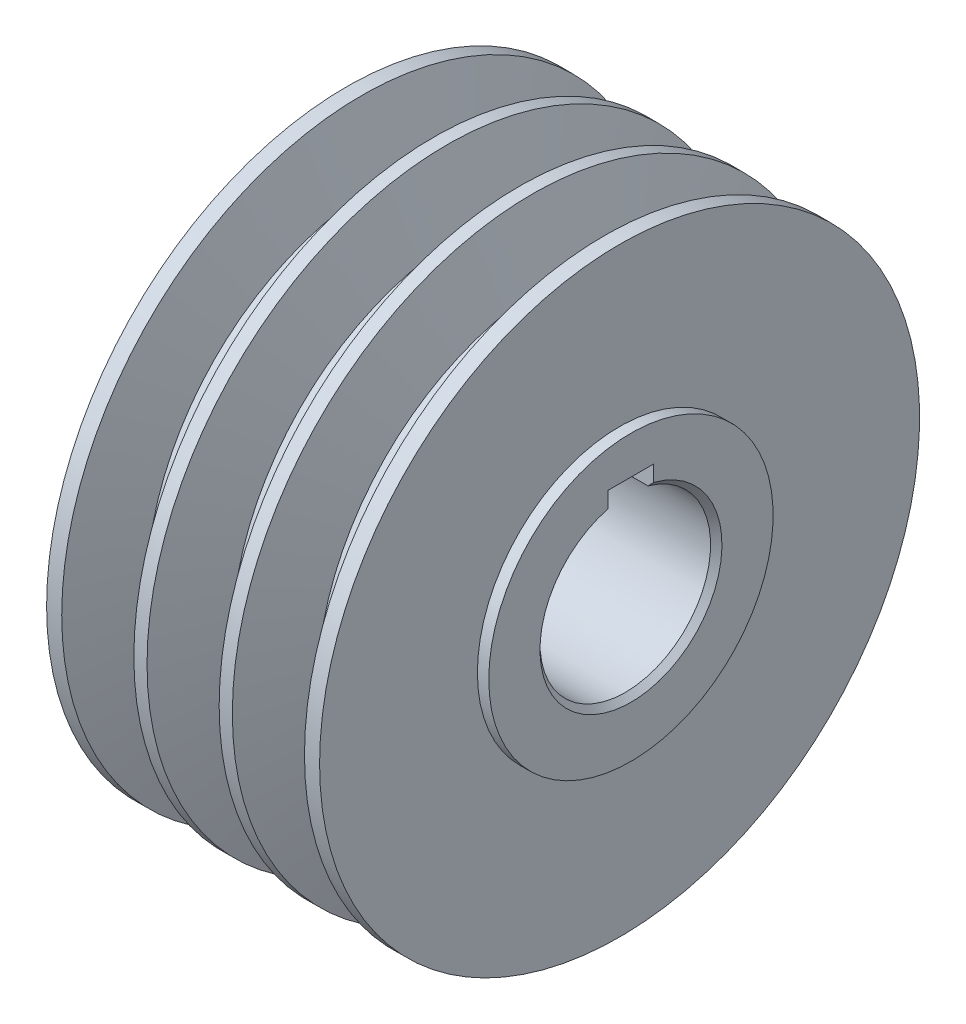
from build123d import *

# Parameters (mm, degrees)
PATTERN_LINEAR_1_COUNT = 3
PATTERN_LINEAR_1_PITCH = 15
CHAMFER_1_SIZE         = 1
SKETCH_4_W             = 8
SKETCH_4_H             = 3.843167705
CUT_EXTRUDE_1_DEPTH    = 90.806040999


with BuildPart() as part:
    # Sketch 1 → Revolve 1 (revolve)
    with BuildSketch(Plane.XY, mode=Mode.PRIVATE) as revolve_1_sk:
        Polygon((0, 15), (0, 52.75), (48, 52.75), (48, 25), (50, 25), (50, 15), align=None)
    revolve(revolve_1_sk.sketch.rotate(Axis((0, 0, 0), (1, 0, 0)), 90), axis=Axis((0, 0, 0), (1, 0, 0)))

    # Sketch 2 → Cut-Revolve 1 (revolve, cut)
    with BuildSketch(Plane.XY, mode=Mode.PRIVATE) as cut_revolve_1_sk:
        Polygon((11.840143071, 41.3), (15.340759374, 52.75), (2.659240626, 52.75), (6.159856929, 41.3), align=None)
    cut_revolve_1 = revolve(cut_revolve_1_sk.sketch.rotate(Axis((0, 0, 0), (1, 0, 0)), 90), axis=Axis((0, 0, 0), (1, 0, 0)), mode=Mode.SUBTRACT)

    # Pattern Linear 1: Cut-Revolve 1 ×3
    with Locations(*[(i * PATTERN_LINEAR_1_PITCH, 0, 0) for i in range(1, PATTERN_LINEAR_1_COUNT)]):
        add(cut_revolve_1, mode=Mode.SUBTRACT)

    # Chamfer 1
    chamfer_1_edges = [part.edges().sort_by_distance(p)[0] for p in [
        (50, 0, -15),
        (0, 0, -15),
    ]]
    chamfer(chamfer_1_edges, length=CHAMFER_1_SIZE)

    # Sketch 4 → Cut-Extrude 1 (cut, through all)
    with BuildSketch(Plane.ZY):
        with Locations((0, 16.378416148)):
            Rectangle(SKETCH_4_W, SKETCH_4_H)
    extrude(amount=-CUT_EXTRUDE_1_DEPTH, mode=Mode.SUBTRACT)


solid = part.part
